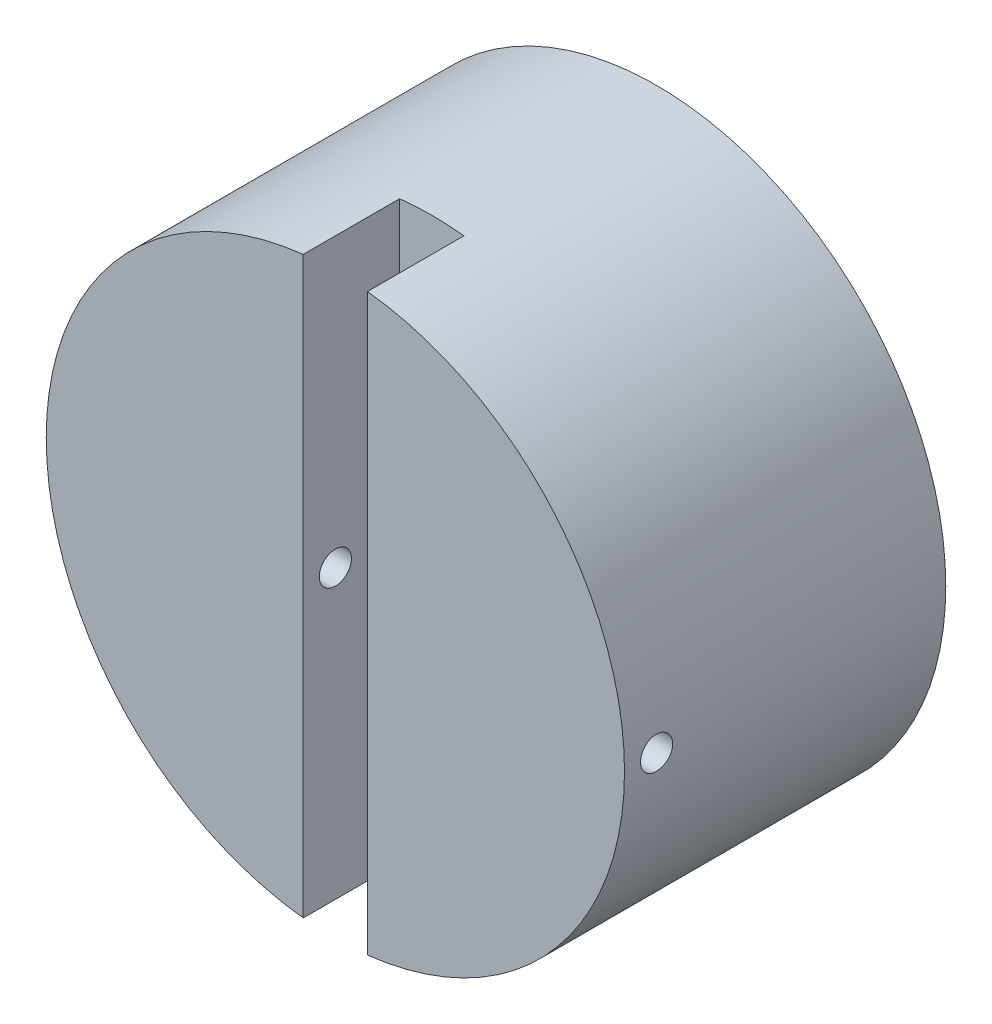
from build123d import *

# Parameters (mm, degrees)
IZIM1_R                     = 90
Y_KSEKLIK_EKSTR_ZYON1_DEPTH = 100
KES_EKSTR_ZYON1_DEPTH       = 100
KES_EKSTR_ZYON1_DEPTH_BACK  = 100
IZIM2_W                     = 20
IZIM2_H                     = 60
KES_EKSTR_ZYON2_DEPTH       = 200
KES_EKSTR_ZYON2_DEPTH_BACK  = 200
IZIM3_R                     = 5


with BuildPart() as part:
    # izim1 → Y_kseklik-Ekstr_zyon1 (new body)
    with BuildSketch(Plane.XY):
        with Locations(Location((0, 0, 0), (0, 0, 180))):
            Circle(IZIM1_R)
    extrude(amount=Y_KSEKLIK_EKSTR_ZYON1_DEPTH)

    # izim2 → Kes-Ekstr_zyon1 (cut, two sides: drawn at the far end of the back side and taken through both)
    with BuildSketch(Plane(origin=(0, 0, 0), x_dir=(1, 0, 0), z_dir=(0, 1, 0)).offset(-KES_EKSTR_ZYON1_DEPTH_BACK)):
        with Locations((0, -100)):
            Rectangle(IZIM2_W, IZIM2_H)
    extrude(amount=KES_EKSTR_ZYON1_DEPTH + KES_EKSTR_ZYON1_DEPTH_BACK, mode=Mode.SUBTRACT)

    # izim3 → Kes-Ekstr_zyon2 (cut, two sides: drawn at the far end of the back side and taken through both)
    with BuildSketch(Plane(origin=(0, 0, 0), x_dir=(0, 0, -1), z_dir=(1, 0, 0)).offset(-KES_EKSTR_ZYON2_DEPTH_BACK)):
        with Locations(Location((-90, 0, 0), (0, 0, 180))):
            Circle(IZIM3_R)
    extrude(amount=KES_EKSTR_ZYON2_DEPTH + KES_EKSTR_ZYON2_DEPTH_BACK, mode=Mode.SUBTRACT)


solid = part.part
